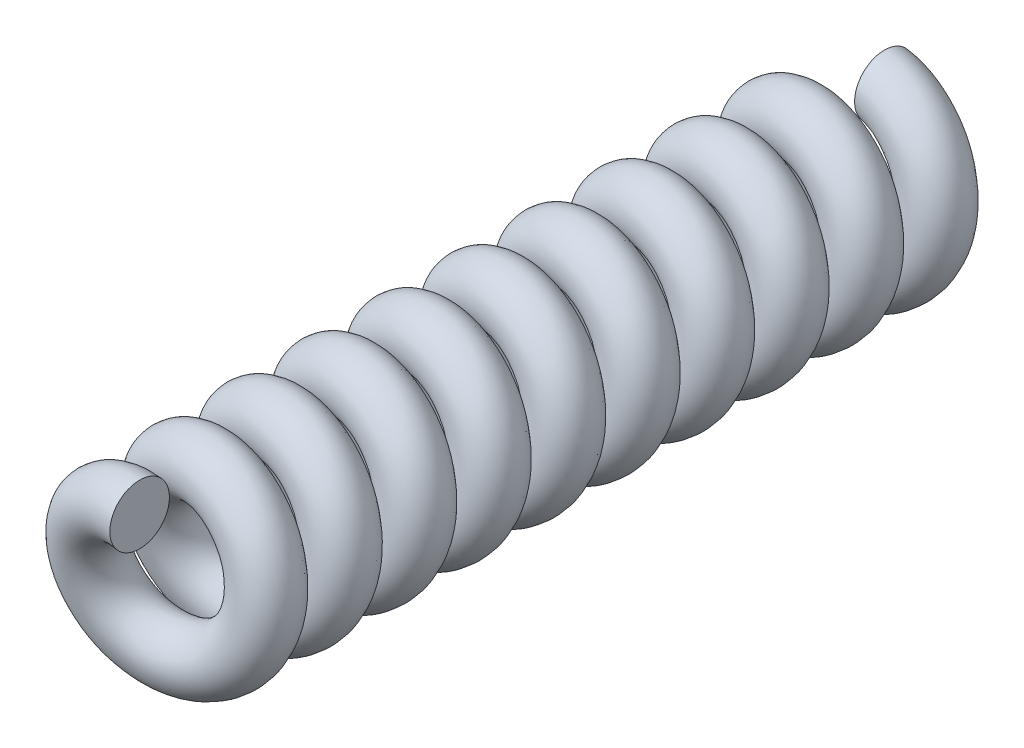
from build123d import *

# Parameters (mm, degrees)
T_HNOUT_PO_K_IVCE1_PITCH       = 1.5
T_HNOUT_PO_K_IVCE1_HEIGHT      = 15
T_HNOUT_PO_K_IVCE1_RADIUS      = 1.4
T_HNOUT_PO_K_IVCE1_START_ANGLE = 90
SKICA2_R                       = 0.6


with BuildPart() as part:
    # T_hnout po k_ivce1: sweep along a helix
    with BuildLine() as t_hnout_po_k_ivce1_path:
        add(Helix(T_HNOUT_PO_K_IVCE1_PITCH, T_HNOUT_PO_K_IVCE1_HEIGHT, T_HNOUT_PO_K_IVCE1_RADIUS, center=(0, 0, 0), direction=(0, 0, 1), lefthand=True, mode=Mode.PRIVATE).rotate(Axis((0, 0, 0), (0, 0, 1)), T_HNOUT_PO_K_IVCE1_START_ANGLE))
    # Skica2 → T_hnout po k_ivce1 (sweep)
    with BuildSketch(Plane(origin=(0, 0, 0), x_dir=(0, 0, -1), z_dir=(1, 0, 0))):
        with Locations((0, 1.4)):
            Circle(SKICA2_R)
    sweep(path=t_hnout_po_k_ivce1_path.line, is_frenet=True)


solid = part.part
